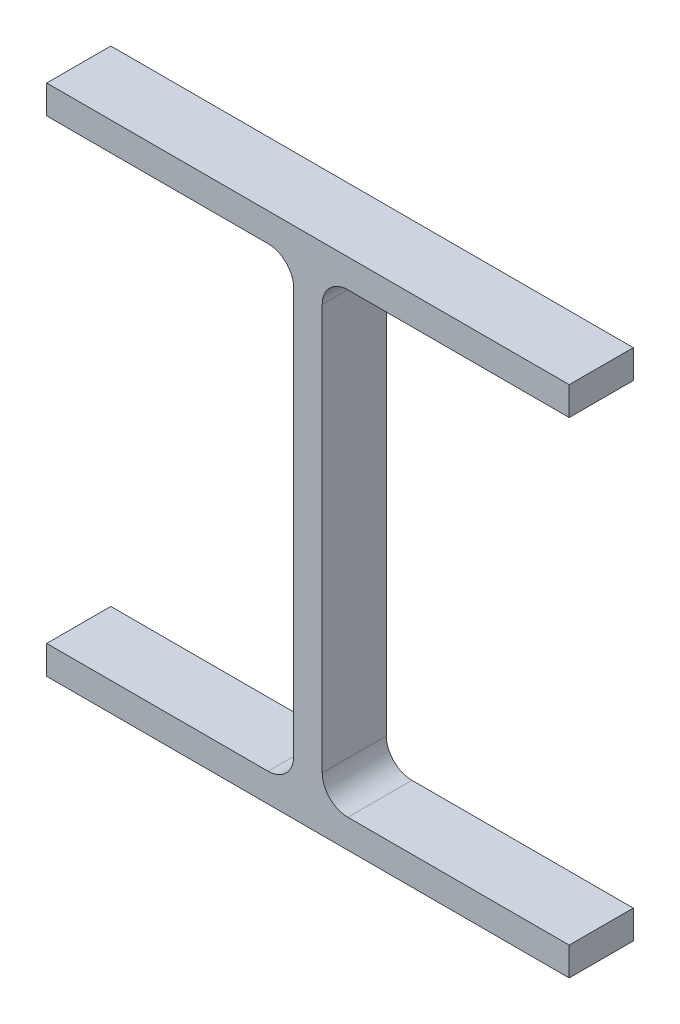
ISO-10303-21;
HEADER;
FILE_DESCRIPTION(('STEP AP214'),'2;1');
FILE_NAME('part.step','',(''),(''),'','','');
FILE_SCHEMA(('AUTOMOTIVE_DESIGN { 1 0 10303 214 1 1 1 1 }'));
ENDSEC;
DATA;
#1=APPLICATION_CONTEXT('core data for automotive mechanical design processes');
#2=APPLICATION_PROTOCOL_DEFINITION('international standard','automotive_design',2000,#1);
#3=PRODUCT_CONTEXT('',#1,'mechanical');
#4=PRODUCT('Part','Part','',(#3));
#5=PRODUCT_RELATED_PRODUCT_CATEGORY('part','',(#4));
#6=PRODUCT_DEFINITION_FORMATION('','',#4);
#7=PRODUCT_DEFINITION_CONTEXT('part definition',#1,'design');
#8=PRODUCT_DEFINITION('design','',#6,#7);
#9=PRODUCT_DEFINITION_SHAPE('','',#8);
#10=(LENGTH_UNIT() NAMED_UNIT(*) SI_UNIT(.MILLI.,.METRE.));
#11=(NAMED_UNIT(*) PLANE_ANGLE_UNIT() SI_UNIT($,.RADIAN.));
#12=(NAMED_UNIT(*) SI_UNIT($,.STERADIAN.) SOLID_ANGLE_UNIT());
#13=UNCERTAINTY_MEASURE_WITH_UNIT(LENGTH_MEASURE(1.E-05),#10,'distance_accuracy_value','');
#14=(GEOMETRIC_REPRESENTATION_CONTEXT(3) GLOBAL_UNCERTAINTY_ASSIGNED_CONTEXT((#13)) GLOBAL_UNIT_ASSIGNED_CONTEXT((#10,
#11,#12)) REPRESENTATION_CONTEXT('',''));
#15=CARTESIAN_POINT('',(0.,0.,0.));
#16=DIRECTION('',(0.,0.,1.));
#17=DIRECTION('',(1.,0.,0.));
#18=AXIS2_PLACEMENT_3D('',#15,#16,#17);
#19=CARTESIAN_POINT('',(207.137,0.,-12.7));
#20=DIRECTION('',(0.,-1.,0.));
#21=DIRECTION('',(0.,0.,-1.));
#22=AXIS2_PLACEMENT_3D('',#19,#20,#21);
#23=PLANE('',#22);
#24=DIRECTION('',(1.,0.,0.));
#25=VECTOR('',#24,1.);
#26=CARTESIAN_POINT('',(207.137,0.,12.7));
#27=LINE('',#26,#25);
#28=CARTESIAN_POINT('',(0.,0.,12.7));
#29=VERTEX_POINT('',#28);
#30=CARTESIAN_POINT('',(207.137,0.,12.7));
#31=VERTEX_POINT('',#30);
#32=EDGE_CURVE('E177',#29,#31,#27,.T.);
#33=ORIENTED_EDGE('',*,*,#32,.F.);
#34=DIRECTION('',(0.,0.,1.));
#35=VECTOR('',#34,1.);
#36=CARTESIAN_POINT('',(0.,0.,-12.7));
#37=LINE('',#36,#35);
#38=CARTESIAN_POINT('',(0.,0.,-12.7));
#39=VERTEX_POINT('',#38);
#40=EDGE_CURVE('E11',#39,#29,#37,.T.);
#41=ORIENTED_EDGE('',*,*,#40,.F.);
#42=DIRECTION('',(1.,0.,0.));
#43=VECTOR('',#42,1.);
#44=CARTESIAN_POINT('',(207.137,0.,-12.7));
#45=LINE('',#44,#43);
#46=CARTESIAN_POINT('',(207.137,0.,-12.7));
#47=VERTEX_POINT('',#46);
#48=EDGE_CURVE('E221',#39,#47,#45,.T.);
#49=ORIENTED_EDGE('',*,*,#48,.T.);
#50=DIRECTION('',(0.,0.,1.));
#51=VECTOR('',#50,1.);
#52=CARTESIAN_POINT('',(207.137,0.,-12.7));
#53=LINE('',#52,#51);
#54=EDGE_CURVE('E35',#47,#31,#53,.T.);
#55=ORIENTED_EDGE('',*,*,#54,.T.);
#56=EDGE_LOOP('',(#33,#41,#49,#55));
#57=FACE_BOUND('',#56,.T.);
#58=ADVANCED_FACE('F32',(#57),#23,.T.);
#59=CARTESIAN_POINT('',(0.,0.,-12.7));
#60=DIRECTION('',(-1.,0.,0.));
#61=DIRECTION('',(0.,-1.,0.));
#62=AXIS2_PLACEMENT_3D('',#59,#60,#61);
#63=PLANE('',#62);
#64=DIRECTION('',(0.,-1.,0.));
#65=VECTOR('',#64,1.);
#66=CARTESIAN_POINT('',(0.,0.,12.7));
#67=LINE('',#66,#65);
#68=CARTESIAN_POINT('',(0.,11.303,12.7));
#69=VERTEX_POINT('',#68);
#70=EDGE_CURVE('E219',#69,#29,#67,.T.);
#71=ORIENTED_EDGE('',*,*,#70,.F.);
#72=DIRECTION('',(0.,0.,1.));
#73=VECTOR('',#72,1.);
#74=CARTESIAN_POINT('',(0.,11.303,-12.7));
#75=LINE('',#74,#73);
#76=CARTESIAN_POINT('',(0.,11.303,-12.7));
#77=VERTEX_POINT('',#76);
#78=EDGE_CURVE('E41',#77,#69,#75,.T.);
#79=ORIENTED_EDGE('',*,*,#78,.F.);
#80=DIRECTION('',(0.,-1.,0.));
#81=VECTOR('',#80,1.);
#82=CARTESIAN_POINT('',(0.,0.,-12.7));
#83=LINE('',#82,#81);
#84=EDGE_CURVE('E167',#77,#39,#83,.T.);
#85=ORIENTED_EDGE('',*,*,#84,.T.);
#86=ORIENTED_EDGE('',*,*,#40,.T.);
#87=EDGE_LOOP('',(#71,#79,#85,#86));
#88=FACE_BOUND('',#87,.T.);
#89=ADVANCED_FACE('F249',(#88),#63,.T.);
#90=CARTESIAN_POINT('',(0.,11.303,-12.7));
#91=DIRECTION('',(0.,1.,0.));
#92=DIRECTION('',(-1.,0.,0.));
#93=AXIS2_PLACEMENT_3D('',#90,#91,#92);
#94=PLANE('',#93);
#95=DIRECTION('',(-1.,0.,0.));
#96=VECTOR('',#95,1.);
#97=CARTESIAN_POINT('',(0.,11.303,12.7));
#98=LINE('',#97,#96);
#99=CARTESIAN_POINT('',(87.757,11.303,12.7));
#100=VERTEX_POINT('',#99);
#101=EDGE_CURVE('E154',#100,#69,#98,.T.);
#102=ORIENTED_EDGE('',*,*,#101,.F.);
#103=DIRECTION('',(0.,0.,1.));
#104=VECTOR('',#103,1.);
#105=CARTESIAN_POINT('',(87.757,11.303,-12.7));
#106=LINE('',#105,#104);
#107=CARTESIAN_POINT('',(87.757,11.303,-12.7));
#108=VERTEX_POINT('',#107);
#109=EDGE_CURVE('E149',#108,#100,#106,.T.);
#110=ORIENTED_EDGE('',*,*,#109,.F.);
#111=DIRECTION('',(-1.,0.,0.));
#112=VECTOR('',#111,1.);
#113=CARTESIAN_POINT('',(0.,11.303,-12.7));
#114=LINE('',#113,#112);
#115=EDGE_CURVE('E152',#108,#77,#114,.T.);
#116=ORIENTED_EDGE('',*,*,#115,.T.);
#117=ORIENTED_EDGE('',*,*,#78,.T.);
#118=EDGE_LOOP('',(#102,#110,#116,#117));
#119=FACE_BOUND('',#118,.T.);
#120=ADVANCED_FACE('F151',(#119),#94,.T.);
#121=CARTESIAN_POINT('',(87.757,21.463,-12.7));
#122=DIRECTION('',(0.,0.,1.));
#123=DIRECTION('',(1.,0.,0.));
#124=AXIS2_PLACEMENT_3D('',#121,#122,#123);
#125=CYLINDRICAL_SURFACE('',#124,10.16);
#126=CARTESIAN_POINT('',(87.757,21.463,12.7));
#127=DIRECTION('',(0.,0.,-1.));
#128=DIRECTION('',(1.,0.,0.));
#129=AXIS2_PLACEMENT_3D('',#126,#127,#128);
#130=CIRCLE('',#129,10.16);
#131=CARTESIAN_POINT('',(97.9169999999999,21.463,12.7));
#132=VERTEX_POINT('',#131);
#133=EDGE_CURVE('E216',#132,#100,#130,.T.);
#134=ORIENTED_EDGE('',*,*,#133,.F.);
#135=DIRECTION('',(0.,0.,1.));
#136=VECTOR('',#135,1.);
#137=CARTESIAN_POINT('',(97.9169999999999,21.463,-12.7));
#138=LINE('',#137,#136);
#139=CARTESIAN_POINT('',(97.9169999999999,21.463,-12.7));
#140=VERTEX_POINT('',#139);
#141=EDGE_CURVE('E159',#140,#132,#138,.T.);
#142=ORIENTED_EDGE('',*,*,#141,.F.);
#143=CARTESIAN_POINT('',(87.757,21.463,-12.7));
#144=DIRECTION('',(0.,0.,-1.));
#145=DIRECTION('',(1.,0.,0.));
#146=AXIS2_PLACEMENT_3D('',#143,#144,#145);
#147=CIRCLE('',#146,10.16);
#148=EDGE_CURVE('E165',#140,#108,#147,.T.);
#149=ORIENTED_EDGE('',*,*,#148,.T.);
#150=ORIENTED_EDGE('',*,*,#109,.T.);
#151=EDGE_LOOP('',(#134,#142,#149,#150));
#152=FACE_BOUND('',#151,.T.);
#153=ADVANCED_FACE('F169',(#152),#125,.F.);
#154=CARTESIAN_POINT('',(97.9169999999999,21.463,-12.7));
#155=DIRECTION('',(-1.,0.,0.));
#156=DIRECTION('',(0.,-1.,0.));
#157=AXIS2_PLACEMENT_3D('',#154,#155,#156);
#158=PLANE('',#157);
#159=DIRECTION('',(0.,-1.,0.));
#160=VECTOR('',#159,1.);
#161=CARTESIAN_POINT('',(97.9169999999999,21.463,12.7));
#162=LINE('',#161,#160);
#163=CARTESIAN_POINT('',(97.9169999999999,182.245,12.7));
#164=VERTEX_POINT('',#163);
#165=EDGE_CURVE('E213',#164,#132,#162,.T.);
#166=ORIENTED_EDGE('',*,*,#165,.F.);
#167=DIRECTION('',(0.,0.,1.));
#168=VECTOR('',#167,1.);
#169=CARTESIAN_POINT('',(97.9169999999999,182.245,-12.7));
#170=LINE('',#169,#168);
#171=CARTESIAN_POINT('',(97.9169999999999,182.245,-12.7));
#172=VERTEX_POINT('',#171);
#173=EDGE_CURVE('E225',#172,#164,#170,.T.);
#174=ORIENTED_EDGE('',*,*,#173,.F.);
#175=DIRECTION('',(0.,-1.,0.));
#176=VECTOR('',#175,1.);
#177=CARTESIAN_POINT('',(97.9169999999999,21.463,-12.7));
#178=LINE('',#177,#176);
#179=EDGE_CURVE('E170',#172,#140,#178,.T.);
#180=ORIENTED_EDGE('',*,*,#179,.T.);
#181=ORIENTED_EDGE('',*,*,#141,.T.);
#182=EDGE_LOOP('',(#166,#174,#180,#181));
#183=FACE_BOUND('',#182,.T.);
#184=ADVANCED_FACE('F262',(#183),#158,.T.);
#185=CARTESIAN_POINT('',(87.7569999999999,182.245,-12.7));
#186=DIRECTION('',(0.,0.,1.));
#187=DIRECTION('',(1.,0.,0.));
#188=AXIS2_PLACEMENT_3D('',#185,#186,#187);
#189=CYLINDRICAL_SURFACE('',#188,10.16);
#190=CARTESIAN_POINT('',(87.7569999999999,182.245,12.7));
#191=DIRECTION('',(0.,0.,-1.));
#192=DIRECTION('',(1.,0.,0.));
#193=AXIS2_PLACEMENT_3D('',#190,#191,#192);
#194=CIRCLE('',#193,10.16);
#195=CARTESIAN_POINT('',(87.7569999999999,192.405,12.7));
#196=VERTEX_POINT('',#195);
#197=EDGE_CURVE('E210',#196,#164,#194,.T.);
#198=ORIENTED_EDGE('',*,*,#197,.F.);
#199=DIRECTION('',(0.,0.,1.));
#200=VECTOR('',#199,1.);
#201=CARTESIAN_POINT('',(87.7569999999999,192.405,-12.7));
#202=LINE('',#201,#200);
#203=CARTESIAN_POINT('',(87.7569999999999,192.405,-12.7));
#204=VERTEX_POINT('',#203);
#205=EDGE_CURVE('E227',#204,#196,#202,.T.);
#206=ORIENTED_EDGE('',*,*,#205,.F.);
#207=CARTESIAN_POINT('',(87.7569999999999,182.245,-12.7));
#208=DIRECTION('',(0.,0.,-1.));
#209=DIRECTION('',(1.,0.,0.));
#210=AXIS2_PLACEMENT_3D('',#207,#208,#209);
#211=CIRCLE('',#210,10.16);
#212=EDGE_CURVE('E172',#204,#172,#211,.T.);
#213=ORIENTED_EDGE('',*,*,#212,.T.);
#214=ORIENTED_EDGE('',*,*,#173,.T.);
#215=EDGE_LOOP('',(#198,#206,#213,#214));
#216=FACE_BOUND('',#215,.T.);
#217=ADVANCED_FACE('F265',(#216),#189,.F.);
#218=CARTESIAN_POINT('',(87.7569999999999,192.405,-12.7));
#219=DIRECTION('',(0.,-1.,0.));
#220=DIRECTION('',(0.,0.,-1.));
#221=AXIS2_PLACEMENT_3D('',#218,#219,#220);
#222=PLANE('',#221);
#223=DIRECTION('',(1.,0.,0.));
#224=VECTOR('',#223,1.);
#225=CARTESIAN_POINT('',(87.7569999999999,192.405,12.7));
#226=LINE('',#225,#224);
#227=CARTESIAN_POINT('',(0.,192.405,12.7));
#228=VERTEX_POINT('',#227);
#229=EDGE_CURVE('E207',#228,#196,#226,.T.);
#230=ORIENTED_EDGE('',*,*,#229,.F.);
#231=DIRECTION('',(0.,0.,1.));
#232=VECTOR('',#231,1.);
#233=CARTESIAN_POINT('',(0.,192.405,-12.7));
#234=LINE('',#233,#232);
#235=CARTESIAN_POINT('',(0.,192.405,-12.7));
#236=VERTEX_POINT('',#235);
#237=EDGE_CURVE('E229',#236,#228,#234,.T.);
#238=ORIENTED_EDGE('',*,*,#237,.F.);
#239=DIRECTION('',(1.,0.,0.));
#240=VECTOR('',#239,1.);
#241=CARTESIAN_POINT('',(87.7569999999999,192.405,-12.7));
#242=LINE('',#241,#240);
#243=EDGE_CURVE('E446',#236,#204,#242,.T.);
#244=ORIENTED_EDGE('',*,*,#243,.T.);
#245=ORIENTED_EDGE('',*,*,#205,.T.);
#246=EDGE_LOOP('',(#230,#238,#244,#245));
#247=FACE_BOUND('',#246,.T.);
#248=ADVANCED_FACE('F269',(#247),#222,.T.);
#249=CARTESIAN_POINT('',(0.,192.405,-12.7));
#250=DIRECTION('',(-1.,0.,0.));
#251=DIRECTION('',(0.,-1.,0.));
#252=AXIS2_PLACEMENT_3D('',#249,#250,#251);
#253=PLANE('',#252);
#254=DIRECTION('',(0.,-1.,0.));
#255=VECTOR('',#254,1.);
#256=CARTESIAN_POINT('',(0.,192.405,12.7));
#257=LINE('',#256,#255);
#258=CARTESIAN_POINT('',(0.,203.708,12.7));
#259=VERTEX_POINT('',#258);
#260=EDGE_CURVE('E204',#259,#228,#257,.T.);
#261=ORIENTED_EDGE('',*,*,#260,.F.);
#262=DIRECTION('',(0.,0.,1.));
#263=VECTOR('',#262,1.);
#264=CARTESIAN_POINT('',(0.,203.708,-12.7));
#265=LINE('',#264,#263);
#266=CARTESIAN_POINT('',(0.,203.708,-12.7));
#267=VERTEX_POINT('',#266);
#268=EDGE_CURVE('E231',#267,#259,#265,.T.);
#269=ORIENTED_EDGE('',*,*,#268,.F.);
#270=DIRECTION('',(0.,-1.,0.));
#271=VECTOR('',#270,1.);
#272=CARTESIAN_POINT('',(0.,192.405,-12.7));
#273=LINE('',#272,#271);
#274=EDGE_CURVE('E442',#267,#236,#273,.T.);
#275=ORIENTED_EDGE('',*,*,#274,.T.);
#276=ORIENTED_EDGE('',*,*,#237,.T.);
#277=EDGE_LOOP('',(#261,#269,#275,#276));
#278=FACE_BOUND('',#277,.T.);
#279=ADVANCED_FACE('F273',(#278),#253,.T.);
#280=CARTESIAN_POINT('',(0.,203.708,-12.7));
#281=DIRECTION('',(0.,1.,0.));
#282=DIRECTION('',(0.,0.,1.));
#283=AXIS2_PLACEMENT_3D('',#280,#281,#282);
#284=PLANE('',#283);
#285=DIRECTION('',(-1.,0.,0.));
#286=VECTOR('',#285,1.);
#287=CARTESIAN_POINT('',(0.,203.708,12.7));
#288=LINE('',#287,#286);
#289=CARTESIAN_POINT('',(207.137,203.708,12.7));
#290=VERTEX_POINT('',#289);
#291=EDGE_CURVE('E201',#290,#259,#288,.T.);
#292=ORIENTED_EDGE('',*,*,#291,.F.);
#293=DIRECTION('',(0.,0.,1.));
#294=VECTOR('',#293,1.);
#295=CARTESIAN_POINT('',(207.137,203.708,-12.7));
#296=LINE('',#295,#294);
#297=CARTESIAN_POINT('',(207.137,203.708,-12.7));
#298=VERTEX_POINT('',#297);
#299=EDGE_CURVE('E233',#298,#290,#296,.T.);
#300=ORIENTED_EDGE('',*,*,#299,.F.);
#301=DIRECTION('',(-1.,0.,0.));
#302=VECTOR('',#301,1.);
#303=CARTESIAN_POINT('',(0.,203.708,-12.7));
#304=LINE('',#303,#302);
#305=EDGE_CURVE('E453',#298,#267,#304,.T.);
#306=ORIENTED_EDGE('',*,*,#305,.T.);
#307=ORIENTED_EDGE('',*,*,#268,.T.);
#308=EDGE_LOOP('',(#292,#300,#306,#307));
#309=FACE_BOUND('',#308,.T.);
#310=ADVANCED_FACE('F277',(#309),#284,.T.);
#311=CARTESIAN_POINT('',(207.137,203.708,-12.7));
#312=DIRECTION('',(1.,0.,0.));
#313=DIRECTION('',(0.,1.,0.));
#314=AXIS2_PLACEMENT_3D('',#311,#312,#313);
#315=PLANE('',#314);
#316=DIRECTION('',(0.,1.,0.));
#317=VECTOR('',#316,1.);
#318=CARTESIAN_POINT('',(207.137,203.708,12.7));
#319=LINE('',#318,#317);
#320=CARTESIAN_POINT('',(207.137,192.405,12.7));
#321=VERTEX_POINT('',#320);
#322=EDGE_CURVE('E198',#321,#290,#319,.T.);
#323=ORIENTED_EDGE('',*,*,#322,.F.);
#324=DIRECTION('',(0.,0.,1.));
#325=VECTOR('',#324,1.);
#326=CARTESIAN_POINT('',(207.137,192.405,-12.7));
#327=LINE('',#326,#325);
#328=CARTESIAN_POINT('',(207.137,192.405,-12.7));
#329=VERTEX_POINT('',#328);
#330=EDGE_CURVE('E235',#329,#321,#327,.T.);
#331=ORIENTED_EDGE('',*,*,#330,.F.);
#332=DIRECTION('',(0.,1.,0.));
#333=VECTOR('',#332,1.);
#334=CARTESIAN_POINT('',(207.137,203.708,-12.7));
#335=LINE('',#334,#333);
#336=EDGE_CURVE('E435',#329,#298,#335,.T.);
#337=ORIENTED_EDGE('',*,*,#336,.T.);
#338=ORIENTED_EDGE('',*,*,#299,.T.);
#339=EDGE_LOOP('',(#323,#331,#337,#338));
#340=FACE_BOUND('',#339,.T.);
#341=ADVANCED_FACE('F281',(#340),#315,.T.);
#342=CARTESIAN_POINT('',(207.137,192.405,-12.7));
#343=DIRECTION('',(0.,-1.,0.));
#344=DIRECTION('',(1.,0.,0.));
#345=AXIS2_PLACEMENT_3D('',#342,#343,#344);
#346=PLANE('',#345);
#347=DIRECTION('',(1.,0.,0.));
#348=VECTOR('',#347,1.);
#349=CARTESIAN_POINT('',(207.137,192.405,12.7));
#350=LINE('',#349,#348);
#351=CARTESIAN_POINT('',(119.38,192.405,12.7));
#352=VERTEX_POINT('',#351);
#353=EDGE_CURVE('E195',#352,#321,#350,.T.);
#354=ORIENTED_EDGE('',*,*,#353,.F.);
#355=DIRECTION('',(0.,0.,1.));
#356=VECTOR('',#355,1.);
#357=CARTESIAN_POINT('',(119.38,192.405,-12.7));
#358=LINE('',#357,#356);
#359=CARTESIAN_POINT('',(119.38,192.405,-12.7));
#360=VERTEX_POINT('',#359);
#361=EDGE_CURVE('E237',#360,#352,#358,.T.);
#362=ORIENTED_EDGE('',*,*,#361,.F.);
#363=DIRECTION('',(1.,0.,0.));
#364=VECTOR('',#363,1.);
#365=CARTESIAN_POINT('',(207.137,192.405,-12.7));
#366=LINE('',#365,#364);
#367=EDGE_CURVE('E431',#360,#329,#366,.T.);
#368=ORIENTED_EDGE('',*,*,#367,.T.);
#369=ORIENTED_EDGE('',*,*,#330,.T.);
#370=EDGE_LOOP('',(#354,#362,#368,#369));
#371=FACE_BOUND('',#370,.T.);
#372=ADVANCED_FACE('F285',(#371),#346,.T.);
#373=CARTESIAN_POINT('',(119.38,182.245,-12.7));
#374=DIRECTION('',(0.,0.,1.));
#375=DIRECTION('',(1.,0.,0.));
#376=AXIS2_PLACEMENT_3D('',#373,#374,#375);
#377=CYLINDRICAL_SURFACE('',#376,10.16);
#378=CARTESIAN_POINT('',(119.38,182.245,12.7));
#379=DIRECTION('',(0.,0.,-1.));
#380=DIRECTION('',(1.,0.,0.));
#381=AXIS2_PLACEMENT_3D('',#378,#379,#380);
#382=CIRCLE('',#381,10.16);
#383=CARTESIAN_POINT('',(109.22,182.245,12.7));
#384=VERTEX_POINT('',#383);
#385=EDGE_CURVE('E192',#384,#352,#382,.T.);
#386=ORIENTED_EDGE('',*,*,#385,.F.);
#387=DIRECTION('',(0.,0.,1.));
#388=VECTOR('',#387,1.);
#389=CARTESIAN_POINT('',(109.22,182.245,-12.7));
#390=LINE('',#389,#388);
#391=CARTESIAN_POINT('',(109.22,182.245,-12.7));
#392=VERTEX_POINT('',#391);
#393=EDGE_CURVE('E239',#392,#384,#390,.T.);
#394=ORIENTED_EDGE('',*,*,#393,.F.);
#395=CARTESIAN_POINT('',(119.38,182.245,-12.7));
#396=DIRECTION('',(0.,0.,-1.));
#397=DIRECTION('',(1.,0.,0.));
#398=AXIS2_PLACEMENT_3D('',#395,#396,#397);
#399=CIRCLE('',#398,10.16);
#400=EDGE_CURVE('E457',#392,#360,#399,.T.);
#401=ORIENTED_EDGE('',*,*,#400,.T.);
#402=ORIENTED_EDGE('',*,*,#361,.T.);
#403=EDGE_LOOP('',(#386,#394,#401,#402));
#404=FACE_BOUND('',#403,.T.);
#405=ADVANCED_FACE('F289',(#404),#377,.F.);
#406=CARTESIAN_POINT('',(109.22,182.245,-12.7));
#407=DIRECTION('',(1.,0.,0.));
#408=DIRECTION('',(0.,1.,0.));
#409=AXIS2_PLACEMENT_3D('',#406,#407,#408);
#410=PLANE('',#409);
#411=DIRECTION('',(0.,1.,0.));
#412=VECTOR('',#411,1.);
#413=CARTESIAN_POINT('',(109.22,182.245,12.7));
#414=LINE('',#413,#412);
#415=CARTESIAN_POINT('',(109.22,21.463,12.7));
#416=VERTEX_POINT('',#415);
#417=EDGE_CURVE('E189',#416,#384,#414,.T.);
#418=ORIENTED_EDGE('',*,*,#417,.F.);
#419=DIRECTION('',(0.,0.,1.));
#420=VECTOR('',#419,1.);
#421=CARTESIAN_POINT('',(109.22,21.463,-12.7));
#422=LINE('',#421,#420);
#423=CARTESIAN_POINT('',(109.22,21.463,-12.7));
#424=VERTEX_POINT('',#423);
#425=EDGE_CURVE('E241',#424,#416,#422,.T.);
#426=ORIENTED_EDGE('',*,*,#425,.F.);
#427=DIRECTION('',(0.,1.,0.));
#428=VECTOR('',#427,1.);
#429=CARTESIAN_POINT('',(109.22,182.245,-12.7));
#430=LINE('',#429,#428);
#431=EDGE_CURVE('E424',#424,#392,#430,.T.);
#432=ORIENTED_EDGE('',*,*,#431,.T.);
#433=ORIENTED_EDGE('',*,*,#393,.T.);
#434=EDGE_LOOP('',(#418,#426,#432,#433));
#435=FACE_BOUND('',#434,.T.);
#436=ADVANCED_FACE('F293',(#435),#410,.T.);
#437=CARTESIAN_POINT('',(119.38,21.463,-12.7));
#438=DIRECTION('',(0.,0.,1.));
#439=DIRECTION('',(1.,0.,0.));
#440=AXIS2_PLACEMENT_3D('',#437,#438,#439);
#441=CYLINDRICAL_SURFACE('',#440,10.16);
#442=CARTESIAN_POINT('',(119.38,21.463,12.7));
#443=DIRECTION('',(0.,0.,-1.));
#444=DIRECTION('',(1.,0.,0.));
#445=AXIS2_PLACEMENT_3D('',#442,#443,#444);
#446=CIRCLE('',#445,10.16);
#447=CARTESIAN_POINT('',(119.38,11.303,12.7));
#448=VERTEX_POINT('',#447);
#449=EDGE_CURVE('E186',#448,#416,#446,.T.);
#450=ORIENTED_EDGE('',*,*,#449,.F.);
#451=DIRECTION('',(0.,0.,1.));
#452=VECTOR('',#451,1.);
#453=CARTESIAN_POINT('',(119.38,11.303,-12.7));
#454=LINE('',#453,#452);
#455=CARTESIAN_POINT('',(119.38,11.303,-12.7));
#456=VERTEX_POINT('',#455);
#457=EDGE_CURVE('E243',#456,#448,#454,.T.);
#458=ORIENTED_EDGE('',*,*,#457,.F.);
#459=CARTESIAN_POINT('',(119.38,21.463,-12.7));
#460=DIRECTION('',(0.,0.,-1.));
#461=DIRECTION('',(1.,0.,0.));
#462=AXIS2_PLACEMENT_3D('',#459,#460,#461);
#463=CIRCLE('',#462,10.16);
#464=EDGE_CURVE('E420',#456,#424,#463,.T.);
#465=ORIENTED_EDGE('',*,*,#464,.T.);
#466=ORIENTED_EDGE('',*,*,#425,.T.);
#467=EDGE_LOOP('',(#450,#458,#465,#466));
#468=FACE_BOUND('',#467,.T.);
#469=ADVANCED_FACE('F297',(#468),#441,.F.);
#470=CARTESIAN_POINT('',(119.38,11.303,-12.7));
#471=DIRECTION('',(0.,1.,0.));
#472=DIRECTION('',(-1.,0.,0.));
#473=AXIS2_PLACEMENT_3D('',#470,#471,#472);
#474=PLANE('',#473);
#475=DIRECTION('',(-1.,0.,0.));
#476=VECTOR('',#475,1.);
#477=CARTESIAN_POINT('',(119.38,11.303,12.7));
#478=LINE('',#477,#476);
#479=CARTESIAN_POINT('',(207.137,11.303,12.7));
#480=VERTEX_POINT('',#479);
#481=EDGE_CURVE('E183',#480,#448,#478,.T.);
#482=ORIENTED_EDGE('',*,*,#481,.F.);
#483=DIRECTION('',(0.,0.,1.));
#484=VECTOR('',#483,1.);
#485=CARTESIAN_POINT('',(207.137,11.303,-12.7));
#486=LINE('',#485,#484);
#487=CARTESIAN_POINT('',(207.137,11.303,-12.7));
#488=VERTEX_POINT('',#487);
#489=EDGE_CURVE('E244',#488,#480,#486,.T.);
#490=ORIENTED_EDGE('',*,*,#489,.F.);
#491=DIRECTION('',(-1.,0.,0.));
#492=VECTOR('',#491,1.);
#493=CARTESIAN_POINT('',(119.38,11.303,-12.7));
#494=LINE('',#493,#492);
#495=EDGE_CURVE('E461',#488,#456,#494,.T.);
#496=ORIENTED_EDGE('',*,*,#495,.T.);
#497=ORIENTED_EDGE('',*,*,#457,.T.);
#498=EDGE_LOOP('',(#482,#490,#496,#497));
#499=FACE_BOUND('',#498,.T.);
#500=ADVANCED_FACE('F301',(#499),#474,.T.);
#501=CARTESIAN_POINT('',(207.137,11.303,-12.7));
#502=DIRECTION('',(1.,0.,0.));
#503=DIRECTION('',(0.,0.,-1.));
#504=AXIS2_PLACEMENT_3D('',#501,#502,#503);
#505=PLANE('',#504);
#506=DIRECTION('',(0.,1.,0.));
#507=VECTOR('',#506,1.);
#508=CARTESIAN_POINT('',(207.137,11.303,12.7));
#509=LINE('',#508,#507);
#510=EDGE_CURVE('E180',#31,#480,#509,.T.);
#511=ORIENTED_EDGE('',*,*,#510,.F.);
#512=ORIENTED_EDGE('',*,*,#54,.F.);
#513=DIRECTION('',(0.,1.,0.));
#514=VECTOR('',#513,1.);
#515=CARTESIAN_POINT('',(207.137,11.303,-12.7));
#516=LINE('',#515,#514);
#517=EDGE_CURVE('E463',#47,#488,#516,.T.);
#518=ORIENTED_EDGE('',*,*,#517,.T.);
#519=ORIENTED_EDGE('',*,*,#489,.T.);
#520=EDGE_LOOP('',(#511,#512,#518,#519));
#521=FACE_BOUND('',#520,.T.);
#522=ADVANCED_FACE('F246',(#521),#505,.T.);
#523=CARTESIAN_POINT('',(87.757,21.463,-12.7));
#524=DIRECTION('',(0.,0.,1.));
#525=DIRECTION('',(1.,0.,0.));
#526=AXIS2_PLACEMENT_3D('',#523,#524,#525);
#527=PLANE('',#526);
#528=ORIENTED_EDGE('',*,*,#48,.F.);
#529=ORIENTED_EDGE('',*,*,#84,.F.);
#530=ORIENTED_EDGE('',*,*,#115,.F.);
#531=ORIENTED_EDGE('',*,*,#148,.F.);
#532=ORIENTED_EDGE('',*,*,#179,.F.);
#533=ORIENTED_EDGE('',*,*,#212,.F.);
#534=ORIENTED_EDGE('',*,*,#243,.F.);
#535=ORIENTED_EDGE('',*,*,#274,.F.);
#536=ORIENTED_EDGE('',*,*,#305,.F.);
#537=ORIENTED_EDGE('',*,*,#336,.F.);
#538=ORIENTED_EDGE('',*,*,#367,.F.);
#539=ORIENTED_EDGE('',*,*,#400,.F.);
#540=ORIENTED_EDGE('',*,*,#431,.F.);
#541=ORIENTED_EDGE('',*,*,#464,.F.);
#542=ORIENTED_EDGE('',*,*,#495,.F.);
#543=ORIENTED_EDGE('',*,*,#517,.F.);
#544=EDGE_LOOP('',(#528,#529,#530,#531,#532,#533,#534,#535,#536,#537,#538,#539,#540,#541,#542,#543));
#545=FACE_BOUND('',#544,.T.);
#546=ADVANCED_FACE('F163',(#545),#527,.F.);
#547=CARTESIAN_POINT('',(87.757,21.463,12.7));
#548=DIRECTION('',(0.,0.,1.));
#549=DIRECTION('',(1.,0.,0.));
#550=AXIS2_PLACEMENT_3D('',#547,#548,#549);
#551=PLANE('',#550);
#552=ORIENTED_EDGE('',*,*,#32,.T.);
#553=ORIENTED_EDGE('',*,*,#510,.T.);
#554=ORIENTED_EDGE('',*,*,#481,.T.);
#555=ORIENTED_EDGE('',*,*,#449,.T.);
#556=ORIENTED_EDGE('',*,*,#417,.T.);
#557=ORIENTED_EDGE('',*,*,#385,.T.);
#558=ORIENTED_EDGE('',*,*,#353,.T.);
#559=ORIENTED_EDGE('',*,*,#322,.T.);
#560=ORIENTED_EDGE('',*,*,#291,.T.);
#561=ORIENTED_EDGE('',*,*,#260,.T.);
#562=ORIENTED_EDGE('',*,*,#229,.T.);
#563=ORIENTED_EDGE('',*,*,#197,.T.);
#564=ORIENTED_EDGE('',*,*,#165,.T.);
#565=ORIENTED_EDGE('',*,*,#133,.T.);
#566=ORIENTED_EDGE('',*,*,#101,.T.);
#567=ORIENTED_EDGE('',*,*,#70,.T.);
#568=EDGE_LOOP('',(#552,#553,#554,#555,#556,#557,#558,#559,#560,#561,#562,#563,#564,#565,#566,#567));
#569=FACE_BOUND('',#568,.T.);
#570=ADVANCED_FACE('F248',(#569),#551,.T.);
#571=CLOSED_SHELL('',(#58,#89,#120,#153,#184,#217,#248,#279,#310,#341,#372,#405,#436,#469,#500,
#522,#546,#570));
#572=MANIFOLD_SOLID_BREP('B2',#571);
#573=ADVANCED_BREP_SHAPE_REPRESENTATION('',(#18,#572),#14);
#574=SHAPE_DEFINITION_REPRESENTATION(#9,#573);
ENDSEC;
END-ISO-10303-21;
